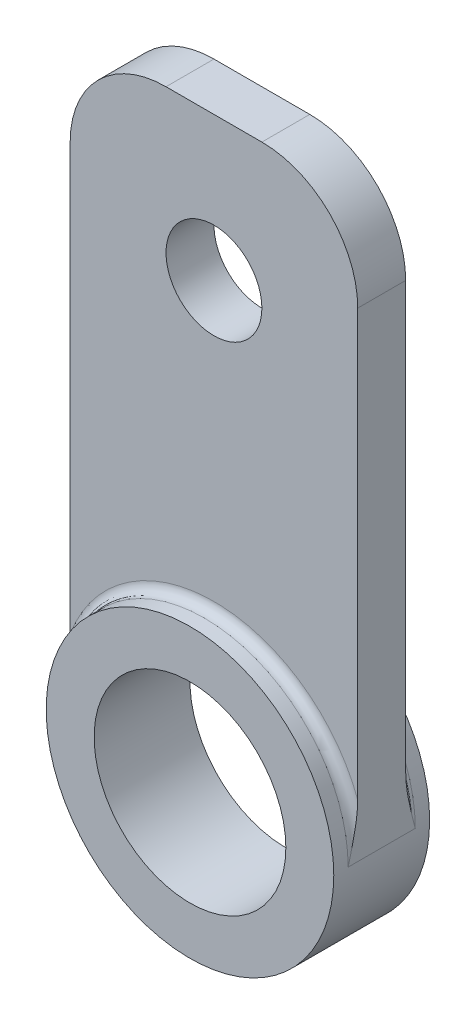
ISO-10303-21;
HEADER;
FILE_DESCRIPTION(('STEP AP214'),'2;1');
FILE_NAME('part.step','',(''),(''),'','','');
FILE_SCHEMA(('AUTOMOTIVE_DESIGN { 1 0 10303 214 1 1 1 1 }'));
ENDSEC;
DATA;
#1=APPLICATION_CONTEXT('core data for automotive mechanical design processes');
#2=APPLICATION_PROTOCOL_DEFINITION('international standard','automotive_design',2000,#1);
#3=PRODUCT_CONTEXT('',#1,'mechanical');
#4=PRODUCT('Part','Part','',(#3));
#5=PRODUCT_RELATED_PRODUCT_CATEGORY('part','',(#4));
#6=PRODUCT_DEFINITION_FORMATION('','',#4);
#7=PRODUCT_DEFINITION_CONTEXT('part definition',#1,'design');
#8=PRODUCT_DEFINITION('design','',#6,#7);
#9=PRODUCT_DEFINITION_SHAPE('','',#8);
#10=(LENGTH_UNIT() NAMED_UNIT(*) SI_UNIT(.MILLI.,.METRE.));
#11=(NAMED_UNIT(*) PLANE_ANGLE_UNIT() SI_UNIT($,.RADIAN.));
#12=(NAMED_UNIT(*) SI_UNIT($,.STERADIAN.) SOLID_ANGLE_UNIT());
#13=UNCERTAINTY_MEASURE_WITH_UNIT(LENGTH_MEASURE(1.E-05),#10,'distance_accuracy_value','');
#14=(GEOMETRIC_REPRESENTATION_CONTEXT(3) GLOBAL_UNCERTAINTY_ASSIGNED_CONTEXT((#13)) GLOBAL_UNIT_ASSIGNED_CONTEXT((#10,
#11,#12)) REPRESENTATION_CONTEXT('',''));
#15=CARTESIAN_POINT('',(0.,0.,0.));
#16=DIRECTION('',(0.,0.,1.));
#17=DIRECTION('',(1.,0.,0.));
#18=AXIS2_PLACEMENT_3D('',#15,#16,#17);
#19=CARTESIAN_POINT('',(0.,0.,5.));
#20=DIRECTION('',(0.,0.,1.));
#21=DIRECTION('',(1.,0.,0.));
#22=AXIS2_PLACEMENT_3D('',#19,#20,#21);
#23=PLANE('',#22);
#24=CARTESIAN_POINT('',(0.,0.,5.));
#25=DIRECTION('',(0.,0.,1.));
#26=DIRECTION('',(1.,0.,0.));
#27=AXIS2_PLACEMENT_3D('',#24,#25,#26);
#28=CIRCLE('',#27,15.);
#29=CARTESIAN_POINT('',(15.,0.,5.));
#30=VERTEX_POINT('',#29);
#31=EDGE_CURVE('E169',#30,#30,#28,.T.);
#32=ORIENTED_EDGE('',*,*,#31,.T.);
#33=EDGE_LOOP('',(#32));
#34=FACE_BOUND('',#33,.T.);
#35=CARTESIAN_POINT('',(0.,0.,5.));
#36=DIRECTION('',(0.,0.,1.));
#37=DIRECTION('',(1.,0.,0.));
#38=AXIS2_PLACEMENT_3D('',#35,#36,#37);
#39=CIRCLE('',#38,10.);
#40=CARTESIAN_POINT('',(10.,0.,5.));
#41=VERTEX_POINT('',#40);
#42=EDGE_CURVE('E163',#41,#41,#39,.T.);
#43=ORIENTED_EDGE('',*,*,#42,.F.);
#44=EDGE_LOOP('',(#43));
#45=FACE_BOUND('',#44,.T.);
#46=ADVANCED_FACE('F37',(#34,#45),#23,.T.);
#47=CARTESIAN_POINT('',(0.,0.,-5.));
#48=DIRECTION('',(0.,0.,1.));
#49=DIRECTION('',(1.,0.,0.));
#50=AXIS2_PLACEMENT_3D('',#47,#48,#49);
#51=PLANE('',#50);
#52=CARTESIAN_POINT('',(0.,0.,-5.));
#53=DIRECTION('',(0.,0.,1.));
#54=DIRECTION('',(1.,0.,0.));
#55=AXIS2_PLACEMENT_3D('',#52,#53,#54);
#56=CIRCLE('',#55,15.);
#57=CARTESIAN_POINT('',(15.,0.,-5.));
#58=VERTEX_POINT('',#57);
#59=EDGE_CURVE('E166',#58,#58,#56,.T.);
#60=ORIENTED_EDGE('',*,*,#59,.F.);
#61=EDGE_LOOP('',(#60));
#62=FACE_BOUND('',#61,.T.);
#63=CARTESIAN_POINT('',(0.,0.,-5.));
#64=DIRECTION('',(0.,0.,1.));
#65=DIRECTION('',(1.,0.,0.));
#66=AXIS2_PLACEMENT_3D('',#63,#64,#65);
#67=CIRCLE('',#66,10.);
#68=CARTESIAN_POINT('',(10.,0.,-5.));
#69=VERTEX_POINT('',#68);
#70=EDGE_CURVE('E121',#69,#69,#67,.T.);
#71=ORIENTED_EDGE('',*,*,#70,.T.);
#72=EDGE_LOOP('',(#71));
#73=FACE_BOUND('',#72,.T.);
#74=ADVANCED_FACE('F236',(#62,#73),#51,.F.);
#75=CARTESIAN_POINT('',(0.,0.,5.));
#76=DIRECTION('',(0.,0.,-1.));
#77=DIRECTION('',(-1.,0.,0.));
#78=AXIS2_PLACEMENT_3D('',#75,#76,#77);
#79=CYLINDRICAL_SURFACE('',#78,15.);
#80=DIRECTION('',(0.,0.,-1.));
#81=VECTOR('',#80,1.);
#82=CARTESIAN_POINT('',(-15.,0.,2.5));
#83=LINE('',#82,#81);
#84=CARTESIAN_POINT('',(-15.,0.,3.5));
#85=VERTEX_POINT('',#84);
#86=CARTESIAN_POINT('',(-15.,0.,-3.5));
#87=VERTEX_POINT('',#86);
#88=EDGE_CURVE('E122',#85,#87,#83,.T.);
#89=ORIENTED_EDGE('',*,*,#88,.T.);
#90=CARTESIAN_POINT('',(0.,0.,-3.5));
#91=DIRECTION('',(0.,0.,1.));
#92=DIRECTION('',(1.,0.,0.));
#93=AXIS2_PLACEMENT_3D('',#90,#91,#92);
#94=CIRCLE('',#93,15.);
#95=CARTESIAN_POINT('',(15.,0.,-3.5));
#96=VERTEX_POINT('',#95);
#97=EDGE_CURVE('E180',#87,#96,#94,.F.);
#98=ORIENTED_EDGE('',*,*,#97,.T.);
#99=DIRECTION('',(0.,0.,-1.));
#100=VECTOR('',#99,1.);
#101=CARTESIAN_POINT('',(15.,0.,2.5));
#102=LINE('',#101,#100);
#103=CARTESIAN_POINT('',(15.,0.,3.5));
#104=VERTEX_POINT('',#103);
#105=EDGE_CURVE('E160',#104,#96,#102,.T.);
#106=ORIENTED_EDGE('',*,*,#105,.F.);
#107=CARTESIAN_POINT('',(0.,0.,3.5));
#108=DIRECTION('',(0.,0.,1.));
#109=DIRECTION('',(1.,0.,0.));
#110=AXIS2_PLACEMENT_3D('',#107,#108,#109);
#111=CIRCLE('',#110,15.);
#112=EDGE_CURVE('E177',#104,#85,#111,.T.);
#113=ORIENTED_EDGE('',*,*,#112,.T.);
#114=EDGE_LOOP('',(#89,#98,#106,#113));
#115=FACE_BOUND('',#114,.T.);
#116=ORIENTED_EDGE('',*,*,#31,.F.);
#117=EDGE_LOOP('',(#116));
#118=FACE_BOUND('',#117,.T.);
#119=ORIENTED_EDGE('',*,*,#59,.T.);
#120=EDGE_LOOP('',(#119));
#121=FACE_BOUND('',#120,.T.);
#122=ADVANCED_FACE('F232',(#115,#118,#121),#79,.T.);
#123=CARTESIAN_POINT('',(0.,0.,5.));
#124=DIRECTION('',(0.,0.,-1.));
#125=DIRECTION('',(-1.,0.,0.));
#126=AXIS2_PLACEMENT_3D('',#123,#124,#125);
#127=CYLINDRICAL_SURFACE('',#126,10.);
#128=ORIENTED_EDGE('',*,*,#42,.T.);
#129=EDGE_LOOP('',(#128));
#130=FACE_BOUND('',#129,.T.);
#131=ORIENTED_EDGE('',*,*,#70,.F.);
#132=EDGE_LOOP('',(#131));
#133=FACE_BOUND('',#132,.T.);
#134=ADVANCED_FACE('F235',(#130,#133),#127,.F.);
#135=CARTESIAN_POINT('',(-5.,50.,2.5));
#136=DIRECTION('',(0.,0.,-1.));
#137=DIRECTION('',(-1.,0.,0.));
#138=AXIS2_PLACEMENT_3D('',#135,#136,#137);
#139=CYLINDRICAL_SURFACE('',#138,10.);
#140=CARTESIAN_POINT('',(-5.,50.,-2.5));
#141=DIRECTION('',(0.,0.,1.));
#142=DIRECTION('',(1.,0.,0.));
#143=AXIS2_PLACEMENT_3D('',#140,#141,#142);
#144=CIRCLE('',#143,10.);
#145=CARTESIAN_POINT('',(-15.,50.,-2.5));
#146=VERTEX_POINT('',#145);
#147=CARTESIAN_POINT('',(-5.,60.,-2.5));
#148=VERTEX_POINT('',#147);
#149=EDGE_CURVE('E120',#146,#148,#144,.F.);
#150=ORIENTED_EDGE('',*,*,#149,.F.);
#151=DIRECTION('',(0.,0.,-1.));
#152=VECTOR('',#151,1.);
#153=CARTESIAN_POINT('',(-15.,50.,2.5));
#154=LINE('',#153,#152);
#155=CARTESIAN_POINT('',(-15.,50.,2.5));
#156=VERTEX_POINT('',#155);
#157=EDGE_CURVE('E109',#156,#146,#154,.T.);
#158=ORIENTED_EDGE('',*,*,#157,.F.);
#159=CARTESIAN_POINT('',(-5.,50.,2.5));
#160=DIRECTION('',(0.,0.,1.));
#161=DIRECTION('',(1.,0.,0.));
#162=AXIS2_PLACEMENT_3D('',#159,#160,#161);
#163=CIRCLE('',#162,10.);
#164=CARTESIAN_POINT('',(-5.,60.,2.5));
#165=VERTEX_POINT('',#164);
#166=EDGE_CURVE('E113',#156,#165,#163,.F.);
#167=ORIENTED_EDGE('',*,*,#166,.T.);
#168=DIRECTION('',(0.,0.,-1.));
#169=VECTOR('',#168,1.);
#170=CARTESIAN_POINT('',(-5.,60.,2.5));
#171=LINE('',#170,#169);
#172=EDGE_CURVE('E143',#165,#148,#171,.T.);
#173=ORIENTED_EDGE('',*,*,#172,.T.);
#174=EDGE_LOOP('',(#150,#158,#167,#173));
#175=FACE_BOUND('',#174,.T.);
#176=ADVANCED_FACE('F117',(#175),#139,.T.);
#177=CARTESIAN_POINT('',(-15.,0.,2.5));
#178=DIRECTION('',(-1.,0.,0.));
#179=DIRECTION('',(0.,0.,1.));
#180=AXIS2_PLACEMENT_3D('',#177,#178,#179);
#181=PLANE('',#180);
#182=DIRECTION('',(0.,1.,0.));
#183=VECTOR('',#182,1.);
#184=CARTESIAN_POINT('',(-15.,0.,-2.5));
#185=LINE('',#184,#183);
#186=CARTESIAN_POINT('',(-15.,5.56776436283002,-2.5));
#187=VERTEX_POINT('',#186);
#188=EDGE_CURVE('E145',#187,#146,#185,.T.);
#189=ORIENTED_EDGE('',*,*,#188,.F.);
#190=CARTESIAN_POINT('',(-15.,5.56776436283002,-2.5));
#191=CARTESIAN_POINT('',(-15.,5.48376264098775,-2.50000654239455));
#192=CARTESIAN_POINT('',(-15.,5.39977075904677,-2.50128091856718));
#193=CARTESIAN_POINT('',(-15.,5.23186558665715,-2.5061151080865));
#194=CARTESIAN_POINT('',(-15.,5.14795228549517,-2.50967454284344));
#195=CARTESIAN_POINT('',(-15.,4.89651705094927,-2.52339825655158));
#196=CARTESIAN_POINT('',(-15.,4.72915921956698,-2.5366087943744));
#197=CARTESIAN_POINT('',(-15.,4.39572185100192,-2.5695611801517));
#198=CARTESIAN_POINT('',(-15.,4.22963988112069,-2.58927936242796));
#199=CARTESIAN_POINT('',(-15.,3.89817152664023,-2.63409257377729));
#200=CARTESIAN_POINT('',(-15.,3.73278532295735,-2.65918892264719));
#201=CARTESIAN_POINT('',(-15.,3.26904040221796,-2.73588675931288));
#202=CARTESIAN_POINT('',(-15.,2.97151330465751,-2.7924886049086));
#203=CARTESIAN_POINT('',(-15.,2.37852906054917,-2.91552291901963));
#204=CARTESIAN_POINT('',(-15.,2.08307212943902,-2.98195639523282));
#205=CARTESIAN_POINT('',(-15.,1.1981314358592,-3.1906909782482));
#206=CARTESIAN_POINT('',(-15.,0.610878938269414,-3.34227235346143));
#207=CARTESIAN_POINT('',(-15.,0.0158113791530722,-3.49591754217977));
#208=CARTESIAN_POINT('',(-15.,0.00790568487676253,-3.49795878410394));
#209=CARTESIAN_POINT('',(-15.,0.,-3.5));
#210=B_SPLINE_CURVE_WITH_KNOTS('',3,(#190,#191,#192,#193,#194,#195,#196,#197,#198,#199,#200,
#201,#202,#203,#204,#205,#206,#207,#208,#209),.UNSPECIFIED.,.F.,.F.,(4,2,2,2,2,2,2,2,2,4),(0.,
0.251980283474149,0.503918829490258,1.00737471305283,1.50901954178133,2.0107876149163,
2.91909735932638,3.82750026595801,5.64675090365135,5.67124580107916),.UNSPECIFIED.);
#211=EDGE_CURVE('E184',#187,#87,#210,.T.);
#212=ORIENTED_EDGE('',*,*,#211,.T.);
#213=ORIENTED_EDGE('',*,*,#88,.F.);
#214=CARTESIAN_POINT('',(-15.,5.56776436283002,2.5));
#215=CARTESIAN_POINT('',(-15.,5.48376264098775,2.50000654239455));
#216=CARTESIAN_POINT('',(-15.,5.39977075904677,2.50128091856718));
#217=CARTESIAN_POINT('',(-15.,5.23186558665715,2.5061151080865));
#218=CARTESIAN_POINT('',(-15.,5.14795228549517,2.50967454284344));
#219=CARTESIAN_POINT('',(-15.,4.89651705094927,2.52339825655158));
#220=CARTESIAN_POINT('',(-15.,4.72915921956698,2.5366087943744));
#221=CARTESIAN_POINT('',(-15.,4.39572185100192,2.5695611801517));
#222=CARTESIAN_POINT('',(-15.,4.22963988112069,2.58927936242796));
#223=CARTESIAN_POINT('',(-15.,3.89817152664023,2.63409257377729));
#224=CARTESIAN_POINT('',(-15.,3.73278532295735,2.65918892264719));
#225=CARTESIAN_POINT('',(-15.,3.26904040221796,2.73588675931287));
#226=CARTESIAN_POINT('',(-15.,2.97151330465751,2.7924886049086));
#227=CARTESIAN_POINT('',(-15.,2.37852906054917,2.91552291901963));
#228=CARTESIAN_POINT('',(-15.,2.08307212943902,2.98195639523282));
#229=CARTESIAN_POINT('',(-15.,1.1981314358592,3.1906909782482));
#230=CARTESIAN_POINT('',(-15.,0.610878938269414,3.34227235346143));
#231=CARTESIAN_POINT('',(-15.,0.0158113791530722,3.49591754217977));
#232=CARTESIAN_POINT('',(-15.,0.00790568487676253,3.49795878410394));
#233=CARTESIAN_POINT('',(-15.,0.,3.5));
#234=B_SPLINE_CURVE_WITH_KNOTS('',3,(#214,#215,#216,#217,#218,#219,#220,#221,#222,#223,#224,
#225,#226,#227,#228,#229,#230,#231,#232,#233),.UNSPECIFIED.,.F.,.F.,(4,2,2,2,2,2,2,2,2,4),(0.,
0.251980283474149,0.503918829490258,1.00737471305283,1.50901954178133,2.0107876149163,
2.91909735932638,3.82750026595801,5.64675090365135,5.67124580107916),.UNSPECIFIED.);
#235=CARTESIAN_POINT('',(-15.,5.56776436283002,2.5));
#236=VERTEX_POINT('',#235);
#237=EDGE_CURVE('E51',#85,#236,#234,.F.);
#238=ORIENTED_EDGE('',*,*,#237,.T.);
#239=DIRECTION('',(0.,1.,0.));
#240=VECTOR('',#239,1.);
#241=CARTESIAN_POINT('',(-15.,0.,2.5));
#242=LINE('',#241,#240);
#243=EDGE_CURVE('E105',#236,#156,#242,.T.);
#244=ORIENTED_EDGE('',*,*,#243,.T.);
#245=ORIENTED_EDGE('',*,*,#157,.T.);
#246=EDGE_LOOP('',(#189,#212,#213,#238,#244,#245));
#247=FACE_BOUND('',#246,.T.);
#248=ADVANCED_FACE('F108',(#247),#181,.T.);
#249=CARTESIAN_POINT('',(15.,0.,2.5));
#250=DIRECTION('',(-1.,0.,0.));
#251=DIRECTION('',(0.,0.,1.));
#252=AXIS2_PLACEMENT_3D('',#249,#250,#251);
#253=PLANE('',#252);
#254=ORIENTED_EDGE('',*,*,#105,.T.);
#255=CARTESIAN_POINT('',(15.,5.56776436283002,-2.5));
#256=CARTESIAN_POINT('',(15.,5.48376264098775,-2.50000654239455));
#257=CARTESIAN_POINT('',(15.,5.39977075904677,-2.50128091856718));
#258=CARTESIAN_POINT('',(15.,5.23186558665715,-2.5061151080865));
#259=CARTESIAN_POINT('',(15.,5.14795228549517,-2.50967454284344));
#260=CARTESIAN_POINT('',(15.,4.89651705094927,-2.52339825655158));
#261=CARTESIAN_POINT('',(15.,4.72915921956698,-2.5366087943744));
#262=CARTESIAN_POINT('',(15.,4.39572185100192,-2.5695611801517));
#263=CARTESIAN_POINT('',(15.,4.22963988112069,-2.58927936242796));
#264=CARTESIAN_POINT('',(15.,3.89817152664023,-2.63409257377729));
#265=CARTESIAN_POINT('',(15.,3.73278532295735,-2.65918892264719));
#266=CARTESIAN_POINT('',(15.,3.26904040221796,-2.73588675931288));
#267=CARTESIAN_POINT('',(15.,2.97151330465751,-2.7924886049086));
#268=CARTESIAN_POINT('',(15.,2.37852906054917,-2.91552291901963));
#269=CARTESIAN_POINT('',(15.,2.08307212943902,-2.98195639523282));
#270=CARTESIAN_POINT('',(15.,1.1981314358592,-3.1906909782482));
#271=CARTESIAN_POINT('',(15.,0.610878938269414,-3.34227235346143));
#272=CARTESIAN_POINT('',(15.,0.0158113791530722,-3.49591754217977));
#273=CARTESIAN_POINT('',(15.,0.00790568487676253,-3.49795878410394));
#274=CARTESIAN_POINT('',(15.,0.,-3.5));
#275=B_SPLINE_CURVE_WITH_KNOTS('',3,(#255,#256,#257,#258,#259,#260,#261,#262,#263,#264,#265,
#266,#267,#268,#269,#270,#271,#272,#273,#274),.UNSPECIFIED.,.F.,.F.,(4,2,2,2,2,2,2,2,2,4),(0.,
0.251980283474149,0.503918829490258,1.00737471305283,1.50901954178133,2.0107876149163,
2.91909735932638,3.82750026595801,5.64675090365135,5.67124580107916),.UNSPECIFIED.);
#276=CARTESIAN_POINT('',(15.,5.56776436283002,-2.5));
#277=VERTEX_POINT('',#276);
#278=EDGE_CURVE('E192',#96,#277,#275,.F.);
#279=ORIENTED_EDGE('',*,*,#278,.T.);
#280=DIRECTION('',(0.,1.,0.));
#281=VECTOR('',#280,1.);
#282=CARTESIAN_POINT('',(15.,0.,-2.5));
#283=LINE('',#282,#281);
#284=CARTESIAN_POINT('',(15.,50.,-2.5));
#285=VERTEX_POINT('',#284);
#286=EDGE_CURVE('E147',#277,#285,#283,.T.);
#287=ORIENTED_EDGE('',*,*,#286,.T.);
#288=DIRECTION('',(0.,0.,-1.));
#289=VECTOR('',#288,1.);
#290=CARTESIAN_POINT('',(15.,50.,2.5));
#291=LINE('',#290,#289);
#292=CARTESIAN_POINT('',(15.,50.,2.5));
#293=VERTEX_POINT('',#292);
#294=EDGE_CURVE('E157',#293,#285,#291,.T.);
#295=ORIENTED_EDGE('',*,*,#294,.F.);
#296=DIRECTION('',(0.,1.,0.));
#297=VECTOR('',#296,1.);
#298=CARTESIAN_POINT('',(15.,0.,2.5));
#299=LINE('',#298,#297);
#300=CARTESIAN_POINT('',(15.,5.56776436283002,2.5));
#301=VERTEX_POINT('',#300);
#302=EDGE_CURVE('E112',#301,#293,#299,.T.);
#303=ORIENTED_EDGE('',*,*,#302,.F.);
#304=CARTESIAN_POINT('',(15.,5.56776436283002,2.5));
#305=CARTESIAN_POINT('',(15.,5.48376264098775,2.50000654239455));
#306=CARTESIAN_POINT('',(15.,5.39977075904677,2.50128091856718));
#307=CARTESIAN_POINT('',(15.,5.23186558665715,2.5061151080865));
#308=CARTESIAN_POINT('',(15.,5.14795228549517,2.50967454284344));
#309=CARTESIAN_POINT('',(15.,4.89651705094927,2.52339825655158));
#310=CARTESIAN_POINT('',(15.,4.72915921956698,2.5366087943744));
#311=CARTESIAN_POINT('',(15.,4.39572185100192,2.5695611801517));
#312=CARTESIAN_POINT('',(15.,4.22963988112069,2.58927936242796));
#313=CARTESIAN_POINT('',(15.,3.89817152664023,2.63409257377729));
#314=CARTESIAN_POINT('',(15.,3.73278532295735,2.65918892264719));
#315=CARTESIAN_POINT('',(15.,3.26904040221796,2.73588675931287));
#316=CARTESIAN_POINT('',(15.,2.97151330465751,2.7924886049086));
#317=CARTESIAN_POINT('',(15.,2.37852906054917,2.91552291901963));
#318=CARTESIAN_POINT('',(15.,2.08307212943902,2.98195639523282));
#319=CARTESIAN_POINT('',(15.,1.1981314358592,3.1906909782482));
#320=CARTESIAN_POINT('',(15.,0.610878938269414,3.34227235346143));
#321=CARTESIAN_POINT('',(15.,0.0158113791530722,3.49591754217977));
#322=CARTESIAN_POINT('',(15.,0.00790568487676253,3.49795878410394));
#323=CARTESIAN_POINT('',(15.,0.,3.5));
#324=B_SPLINE_CURVE_WITH_KNOTS('',3,(#304,#305,#306,#307,#308,#309,#310,#311,#312,#313,#314,
#315,#316,#317,#318,#319,#320,#321,#322,#323),.UNSPECIFIED.,.F.,.F.,(4,2,2,2,2,2,2,2,2,4),(0.,
0.251980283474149,0.503918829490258,1.00737471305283,1.50901954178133,2.0107876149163,
2.91909735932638,3.82750026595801,5.64675090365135,5.67124580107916),.UNSPECIFIED.);
#325=EDGE_CURVE('E11',#301,#104,#324,.T.);
#326=ORIENTED_EDGE('',*,*,#325,.T.);
#327=EDGE_LOOP('',(#254,#279,#287,#295,#303,#326));
#328=FACE_BOUND('',#327,.T.);
#329=ADVANCED_FACE('F203',(#328),#253,.F.);
#330=CARTESIAN_POINT('',(5.,50.,2.5));
#331=DIRECTION('',(0.,0.,-1.));
#332=DIRECTION('',(-1.,0.,0.));
#333=AXIS2_PLACEMENT_3D('',#330,#331,#332);
#334=CYLINDRICAL_SURFACE('',#333,10.);
#335=CARTESIAN_POINT('',(5.,50.,-2.5));
#336=DIRECTION('',(0.,0.,1.));
#337=DIRECTION('',(1.,0.,0.));
#338=AXIS2_PLACEMENT_3D('',#335,#336,#337);
#339=CIRCLE('',#338,10.);
#340=CARTESIAN_POINT('',(5.,60.,-2.5));
#341=VERTEX_POINT('',#340);
#342=EDGE_CURVE('E149',#341,#285,#339,.F.);
#343=ORIENTED_EDGE('',*,*,#342,.F.);
#344=DIRECTION('',(0.,0.,-1.));
#345=VECTOR('',#344,1.);
#346=CARTESIAN_POINT('',(5.,60.,2.5));
#347=LINE('',#346,#345);
#348=CARTESIAN_POINT('',(5.,60.,2.5));
#349=VERTEX_POINT('',#348);
#350=EDGE_CURVE('E155',#349,#341,#347,.T.);
#351=ORIENTED_EDGE('',*,*,#350,.F.);
#352=CARTESIAN_POINT('',(5.,50.,2.5));
#353=DIRECTION('',(0.,0.,1.));
#354=DIRECTION('',(1.,0.,0.));
#355=AXIS2_PLACEMENT_3D('',#352,#353,#354);
#356=CIRCLE('',#355,10.);
#357=EDGE_CURVE('E136',#349,#293,#356,.F.);
#358=ORIENTED_EDGE('',*,*,#357,.T.);
#359=ORIENTED_EDGE('',*,*,#294,.T.);
#360=EDGE_LOOP('',(#343,#351,#358,#359));
#361=FACE_BOUND('',#360,.T.);
#362=ADVANCED_FACE('F227',(#361),#334,.T.);
#363=CARTESIAN_POINT('',(0.,60.,2.5));
#364=DIRECTION('',(0.,1.,0.));
#365=DIRECTION('',(0.,0.,1.));
#366=AXIS2_PLACEMENT_3D('',#363,#364,#365);
#367=PLANE('',#366);
#368=DIRECTION('',(1.,0.,0.));
#369=VECTOR('',#368,1.);
#370=CARTESIAN_POINT('',(0.,60.,-2.5));
#371=LINE('',#370,#369);
#372=EDGE_CURVE('E132',#148,#341,#371,.T.);
#373=ORIENTED_EDGE('',*,*,#372,.F.);
#374=ORIENTED_EDGE('',*,*,#172,.F.);
#375=DIRECTION('',(1.,0.,0.));
#376=VECTOR('',#375,1.);
#377=CARTESIAN_POINT('',(0.,60.,2.5));
#378=LINE('',#377,#376);
#379=EDGE_CURVE('E128',#165,#349,#378,.T.);
#380=ORIENTED_EDGE('',*,*,#379,.T.);
#381=ORIENTED_EDGE('',*,*,#350,.T.);
#382=EDGE_LOOP('',(#373,#374,#380,#381));
#383=FACE_BOUND('',#382,.T.);
#384=ADVANCED_FACE('F225',(#383),#367,.T.);
#385=CARTESIAN_POINT('',(0.,45.,2.5));
#386=DIRECTION('',(0.,0.,-1.));
#387=DIRECTION('',(-1.,0.,0.));
#388=AXIS2_PLACEMENT_3D('',#385,#386,#387);
#389=CYLINDRICAL_SURFACE('',#388,5.);
#390=CARTESIAN_POINT('',(0.,45.,2.5));
#391=DIRECTION('',(0.,0.,1.));
#392=DIRECTION('',(1.,0.,0.));
#393=AXIS2_PLACEMENT_3D('',#390,#391,#392);
#394=CIRCLE('',#393,5.);
#395=CARTESIAN_POINT('',(5.,45.,2.5));
#396=VERTEX_POINT('',#395);
#397=EDGE_CURVE('E140',#396,#396,#394,.T.);
#398=ORIENTED_EDGE('',*,*,#397,.T.);
#399=EDGE_LOOP('',(#398));
#400=FACE_BOUND('',#399,.T.);
#401=CARTESIAN_POINT('',(0.,45.,-2.5));
#402=DIRECTION('',(0.,0.,1.));
#403=DIRECTION('',(1.,0.,0.));
#404=AXIS2_PLACEMENT_3D('',#401,#402,#403);
#405=CIRCLE('',#404,5.);
#406=CARTESIAN_POINT('',(5.,45.,-2.5));
#407=VERTEX_POINT('',#406);
#408=EDGE_CURVE('E129',#407,#407,#405,.T.);
#409=ORIENTED_EDGE('',*,*,#408,.F.);
#410=EDGE_LOOP('',(#409));
#411=FACE_BOUND('',#410,.T.);
#412=ADVANCED_FACE('F274',(#400,#411),#389,.F.);
#413=CARTESIAN_POINT('',(0.,0.,2.5));
#414=DIRECTION('',(0.,0.,1.));
#415=DIRECTION('',(1.,0.,0.));
#416=AXIS2_PLACEMENT_3D('',#413,#414,#415);
#417=PLANE('',#416);
#418=ORIENTED_EDGE('',*,*,#243,.F.);
#419=CARTESIAN_POINT('',(0.,0.,2.5));
#420=DIRECTION('',(0.,0.,1.));
#421=DIRECTION('',(1.,0.,0.));
#422=AXIS2_PLACEMENT_3D('',#419,#420,#421);
#423=CIRCLE('',#422,16.);
#424=EDGE_CURVE('E58',#236,#301,#423,.F.);
#425=ORIENTED_EDGE('',*,*,#424,.T.);
#426=ORIENTED_EDGE('',*,*,#302,.T.);
#427=ORIENTED_EDGE('',*,*,#357,.F.);
#428=ORIENTED_EDGE('',*,*,#379,.F.);
#429=ORIENTED_EDGE('',*,*,#166,.F.);
#430=EDGE_LOOP('',(#418,#425,#426,#427,#428,#429));
#431=FACE_BOUND('',#430,.T.);
#432=ORIENTED_EDGE('',*,*,#397,.F.);
#433=EDGE_LOOP('',(#432));
#434=FACE_BOUND('',#433,.T.);
#435=ADVANCED_FACE('F124',(#431,#434),#417,.T.);
#436=CARTESIAN_POINT('',(0.,0.,-2.5));
#437=DIRECTION('',(0.,0.,1.));
#438=DIRECTION('',(1.,0.,0.));
#439=AXIS2_PLACEMENT_3D('',#436,#437,#438);
#440=PLANE('',#439);
#441=ORIENTED_EDGE('',*,*,#286,.F.);
#442=CARTESIAN_POINT('',(0.,0.,-2.5));
#443=DIRECTION('',(0.,0.,1.));
#444=DIRECTION('',(1.,0.,0.));
#445=AXIS2_PLACEMENT_3D('',#442,#443,#444);
#446=CIRCLE('',#445,16.);
#447=EDGE_CURVE('E172',#277,#187,#446,.T.);
#448=ORIENTED_EDGE('',*,*,#447,.T.);
#449=ORIENTED_EDGE('',*,*,#188,.T.);
#450=ORIENTED_EDGE('',*,*,#149,.T.);
#451=ORIENTED_EDGE('',*,*,#372,.T.);
#452=ORIENTED_EDGE('',*,*,#342,.T.);
#453=EDGE_LOOP('',(#441,#448,#449,#450,#451,#452));
#454=FACE_BOUND('',#453,.T.);
#455=ORIENTED_EDGE('',*,*,#408,.T.);
#456=EDGE_LOOP('',(#455));
#457=FACE_BOUND('',#456,.T.);
#458=ADVANCED_FACE('F220',(#454,#457),#440,.F.);
#459=CARTESIAN_POINT('',(0.,0.,-3.5));
#460=DIRECTION('',(0.,0.,1.));
#461=DIRECTION('',(1.,0.,0.));
#462=AXIS2_PLACEMENT_3D('',#459,#460,#461);
#463=TOROIDAL_SURFACE('',#462,16.,1.);
#464=ORIENTED_EDGE('',*,*,#278,.F.);
#465=ORIENTED_EDGE('',*,*,#97,.F.);
#466=ORIENTED_EDGE('',*,*,#211,.F.);
#467=ORIENTED_EDGE('',*,*,#447,.F.);
#468=EDGE_LOOP('',(#464,#465,#466,#467));
#469=FACE_BOUND('',#468,.T.);
#470=ADVANCED_FACE('F197',(#469),#463,.F.);
#471=CARTESIAN_POINT('',(0.,0.,3.5));
#472=DIRECTION('',(0.,0.,1.));
#473=DIRECTION('',(1.,0.,0.));
#474=AXIS2_PLACEMENT_3D('',#471,#472,#473);
#475=TOROIDAL_SURFACE('',#474,16.,1.);
#476=ORIENTED_EDGE('',*,*,#325,.F.);
#477=ORIENTED_EDGE('',*,*,#424,.F.);
#478=ORIENTED_EDGE('',*,*,#237,.F.);
#479=ORIENTED_EDGE('',*,*,#112,.F.);
#480=EDGE_LOOP('',(#476,#477,#478,#479));
#481=FACE_BOUND('',#480,.T.);
#482=ADVANCED_FACE('F39',(#481),#475,.F.);
#483=CLOSED_SHELL('',(#46,#74,#122,#134,#176,#248,#329,#362,#384,#412,#435,#458,#470,#482));
#484=MANIFOLD_SOLID_BREP('B2',#483);
#485=ADVANCED_BREP_SHAPE_REPRESENTATION('',(#18,#484),#14);
#486=SHAPE_DEFINITION_REPRESENTATION(#9,#485);
ENDSEC;
END-ISO-10303-21;
